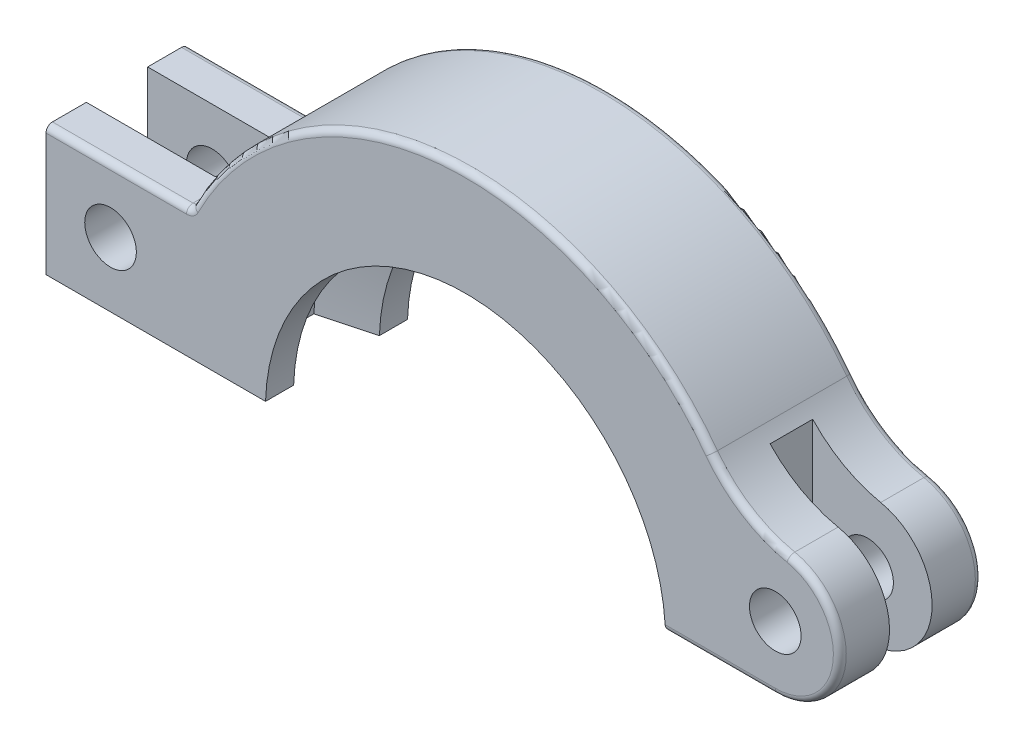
from build123d import *

# Parameters (mm, degrees)
ESQUISSE1_R             = 4
BOSS_EXTRU_1_DEPTH      = 11
ESQUISSE2_W             = 35.863263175
ESQUISSE2_H             = 9.5
ESQUISSE2_W_2           = 29.823165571
ESQUISSE2_H_2           = 6.6
ENL_V_MAT_EXTRU_2_DEPTH = 82.254230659
CONG_1_R                = 1


with BuildPart() as part:
    # Esquisse1 → Boss.-Extru.1 (new, symmetric)
    with BuildSketch(Plane.XY):
        with BuildLine():
            Line((30.98386677, 1), (48, 1))
            ThreePointArc((48, 1), (57.947743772, 9.979023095), (50.031283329, 20.791521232))
            ThreePointArc((50.031283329, 20.791521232), (43.350355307, 23.505143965), (38.066042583, 28.411730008))
            ThreePointArc((38.066042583, 28.411730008), (-4.345764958, 47.30078569), (-42.605750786, 21))
            Line((-42.605750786, 21), (-65, 21))
            Line((-65, 21), (-65, 1))
            Line((-65, 1), (-30.98386677, 1))
            ThreePointArc((-30.98386677, 1), (0, 31), (30.98386677, 1))
        make_face()
        with Locations((-55, 11)):
            Circle(ESQUISSE1_R, mode=Mode.SUBTRACT)
        with Locations((48, 11)):
            Circle(ESQUISSE1_R, mode=Mode.SUBTRACT)
    extrude(amount=BOSS_EXTRU_1_DEPTH, both=True)

    # Esquisse2 → Enl_v. mat.-Extru.2 (cut, through all)
    with BuildSketch(Plane(origin=(0, 0, 0), x_dir=(1, 0, 0), z_dir=(0, 1, 0))):
        with Locations((-62.931631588, 0)):
            Rectangle(ESQUISSE2_W, ESQUISSE2_H)
        with Locations((54.411582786, 0)):
            Rectangle(ESQUISSE2_W_2, ESQUISSE2_H_2)
    extrude(amount=ENL_V_MAT_EXTRU_2_DEPTH, mode=Mode.SUBTRACT)

    # Cong_1
    cong_1_edges = [part.edges().sort_by_distance(p)[0] for p in [
        (39.491933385, 1, 11),
        (-42.605750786, 21, 0),
        (57.947743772, 9.979023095, 11),
        (43.350355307, 23.505143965, 11),
        (-4.345764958, 47.30078569, 11),
        (-53.802875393, 21, 11),
        (-53.802875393, 21, -11),
        (-4.345764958, 47.30078569, -11),
        (43.350355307, 23.505143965, -11),
        (57.947743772, 9.979023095, -11),
        (39.491933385, 1, -11),
    ]]
    fillet(cong_1_edges, radius=CONG_1_R)

    # Esquisse3 → Enl_vement de mati_re-R_volution1 (revolve, cut)
    with BuildSketch(Plane(origin=(0, 0, 0), x_dir=(1, 0, 0), z_dir=(0, 1, 0))):
        Polygon((-39, -4.5), (-39, 4.5), (-26.508507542, 7.847085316), (-26.508507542, -7.847085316), align=None)
    revolve(axis=Axis((0, 0, 0), (0, 0, -1)), mode=Mode.SUBTRACT)


solid = part.part
